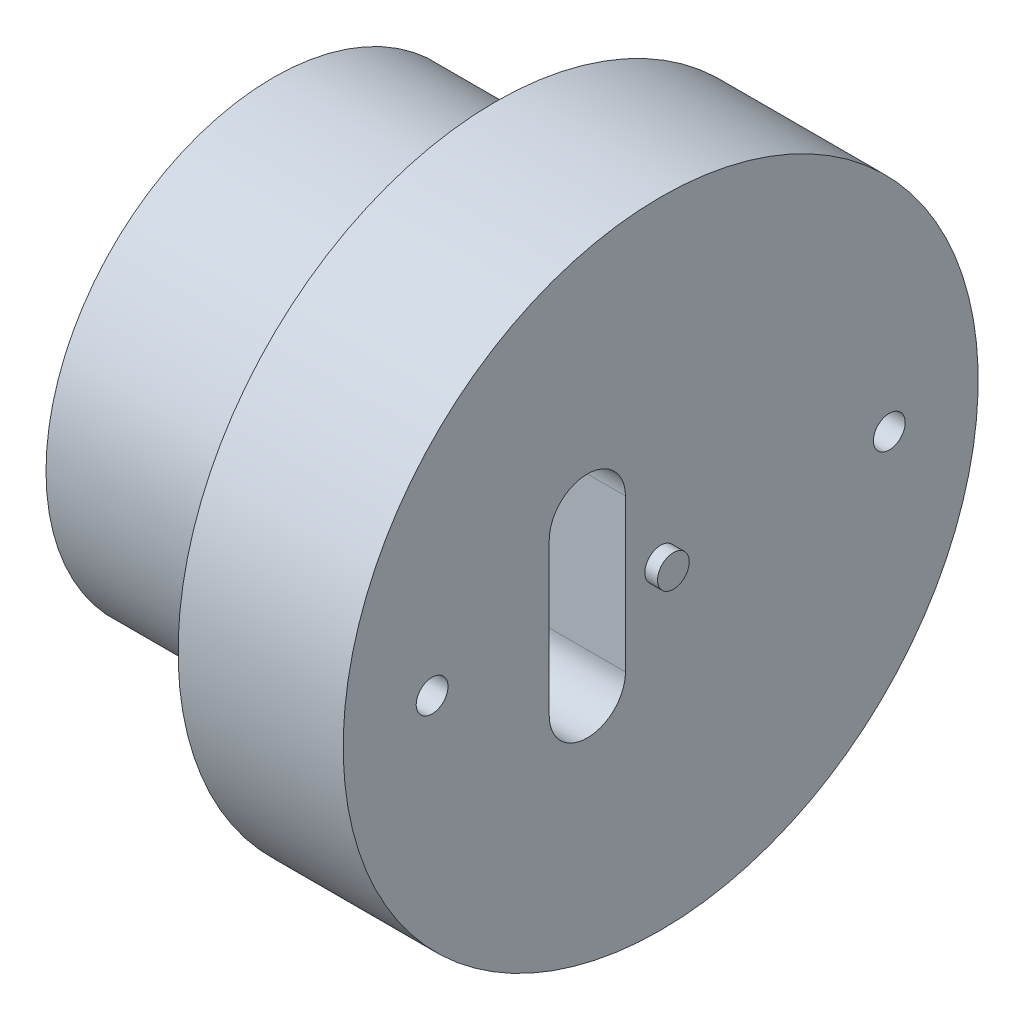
from build123d import *

# Parameters (mm, degrees)
SKETCH2_R             = 24
EXTRUDE1_DEPTH        = 28
M6_TAPPED_HOLE1_D     = 5
M6_TAPPED_HOLE1_DEPTH = 15
M6_TAPPED_HOLE1_TIP   = 1.502151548
EXTRUDE2_DEPTH        = 94.386294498


with BuildPart() as part:
    # Sketch1 → Revolve1 (revolve)
    with BuildSketch(Plane.XY):
        Polygon((0, 0), (0, 35.8), (35, 35.8), (35, 50), (61, 50), (61, 2.5), (63, 2.5), (63, 0), align=None)
    revolve(axis=Axis((63, 0, 0), (-1, 0, 0)))

    # Sketch2 → Extrude1 (cut)
    with BuildSketch(Plane.ZY):
        with Locations(Location((0, 0, 0), (0, 0, 270))):
            Circle(SKETCH2_R)
    extrude(amount=-EXTRUDE1_DEPTH, mode=Mode.SUBTRACT)

    # M6 Tapped Hole1
    with Locations(Plane(origin=(63, 0, 36), x_dir=(0, 1, 0), z_dir=(1, 0, 0))):
        with Locations((0, 0), (0, -72)):
            Hole(M6_TAPPED_HOLE1_D / 2, depth=M6_TAPPED_HOLE1_DEPTH)
            with Locations((0, 0, -(M6_TAPPED_HOLE1_DEPTH + M6_TAPPED_HOLE1_TIP / 2))):  # 118° drill point
                Cone(0, M6_TAPPED_HOLE1_D / 2, M6_TAPPED_HOLE1_TIP, mode=Mode.SUBTRACT)

    # Sketch5 → Extrude2 (cut, through all)
    with BuildSketch(Plane(origin=(61, 0, 0), x_dir=(0, 0, -1), z_dir=(1, 0, 0))):
        with BuildLine():
            Line((-17.55, -12), (-17.55, 12))
            ThreePointArc((-17.55, 12), (-11.55, 18), (-5.55, 12))
            Line((-5.55, 12), (-5.55, -12))
            ThreePointArc((-5.55, -12), (-11.55, -18), (-17.55, -12))
        make_face()
    extrude(amount=-EXTRUDE2_DEPTH, mode=Mode.SUBTRACT)


solid = part.part
